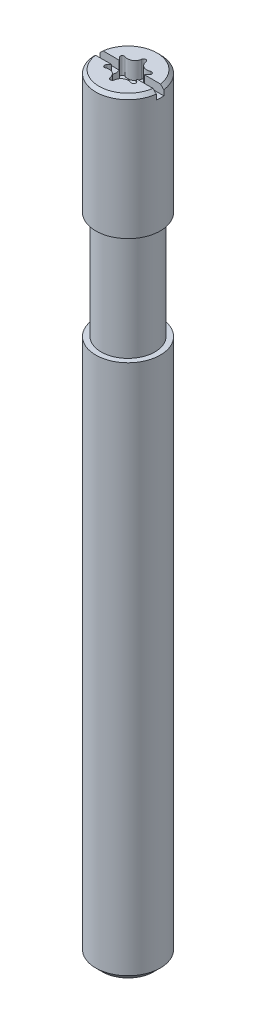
ISO-10303-21;
HEADER;
FILE_DESCRIPTION(('STEP AP214'),'2;1');
FILE_NAME('part.step','',(''),(''),'','','');
FILE_SCHEMA(('AUTOMOTIVE_DESIGN { 1 0 10303 214 1 1 1 1 }'));
ENDSEC;
DATA;
#1=APPLICATION_CONTEXT('core data for automotive mechanical design processes');
#2=APPLICATION_PROTOCOL_DEFINITION('international standard','automotive_design',2000,#1);
#3=PRODUCT_CONTEXT('',#1,'mechanical');
#4=PRODUCT('Part','Part','',(#3));
#5=PRODUCT_RELATED_PRODUCT_CATEGORY('part','',(#4));
#6=PRODUCT_DEFINITION_FORMATION('','',#4);
#7=PRODUCT_DEFINITION_CONTEXT('part definition',#1,'design');
#8=PRODUCT_DEFINITION('design','',#6,#7);
#9=PRODUCT_DEFINITION_SHAPE('','',#8);
#10=(LENGTH_UNIT() NAMED_UNIT(*) SI_UNIT(.MILLI.,.METRE.));
#11=(NAMED_UNIT(*) PLANE_ANGLE_UNIT() SI_UNIT($,.RADIAN.));
#12=(NAMED_UNIT(*) SI_UNIT($,.STERADIAN.) SOLID_ANGLE_UNIT());
#13=UNCERTAINTY_MEASURE_WITH_UNIT(LENGTH_MEASURE(1.E-05),#10,'distance_accuracy_value','');
#14=(GEOMETRIC_REPRESENTATION_CONTEXT(3) GLOBAL_UNCERTAINTY_ASSIGNED_CONTEXT((#13)) GLOBAL_UNIT_ASSIGNED_CONTEXT((#10,
#11,#12)) REPRESENTATION_CONTEXT('',''));
#15=CARTESIAN_POINT('',(0.,0.,0.));
#16=DIRECTION('',(0.,0.,1.));
#17=DIRECTION('',(1.,0.,0.));
#18=AXIS2_PLACEMENT_3D('',#15,#16,#17);
#19=CARTESIAN_POINT('',(-1.52237094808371,39.9,-0.362499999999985));
#20=DIRECTION('',(0.,1.,0.));
#21=DIRECTION('',(0.,0.,1.));
#22=AXIS2_PLACEMENT_3D('',#19,#20,#21);
#23=PLANE('',#22);
#24=CARTESIAN_POINT('',(-0.894502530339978,39.9,1.54932383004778));
#25=DIRECTION('',(0.,1.,0.));
#26=DIRECTION('',(0.,0.,1.));
#27=AXIS2_PLACEMENT_3D('',#24,#25,#26);
#28=CIRCLE('',#27,0.7);
#29=CARTESIAN_POINT('',(-0.198778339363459,39.9,1.47207196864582));
#30=VERTEX_POINT('',#29);
#31=CARTESIAN_POINT('',(-0.464026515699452,39.899999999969,0.997336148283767));
#32=VERTEX_POINT('',#31);
#33=EDGE_CURVE('E359',#30,#32,#28,.T.);
#34=ORIENTED_EDGE('',*,*,#33,.F.);
#35=CARTESIAN_POINT('',(0.,39.9,1.45));
#36=DIRECTION('',(0.,1.,0.));
#37=DIRECTION('',(0.,0.,1.));
#38=AXIS2_PLACEMENT_3D('',#35,#36,#37);
#39=CIRCLE('',#38,0.2);
#40=CARTESIAN_POINT('',(0.198778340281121,39.9,1.47207196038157));
#41=VERTEX_POINT('',#40);
#42=EDGE_CURVE('E568',#30,#41,#39,.T.);
#43=ORIENTED_EDGE('',*,*,#42,.T.);
#44=CARTESIAN_POINT('',(0.894502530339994,39.9,1.54932383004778));
#45=DIRECTION('',(0.,1.,0.));
#46=DIRECTION('',(0.,0.,1.));
#47=AXIS2_PLACEMENT_3D('',#44,#45,#46);
#48=CIRCLE('',#47,0.7);
#49=CARTESIAN_POINT('',(0.464026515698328,39.8999999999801,0.997336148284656));
#50=VERTEX_POINT('',#49);
#51=EDGE_CURVE('E634',#50,#41,#48,.T.);
#52=ORIENTED_EDGE('',*,*,#51,.F.);
#53=CARTESIAN_POINT('',(0.,39.8999999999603,0.));
#54=DIRECTION('',(0.,1.,0.));
#55=DIRECTION('',(0.,0.,1.));
#56=AXIS2_PLACEMENT_3D('',#53,#54,#55);
#57=CIRCLE('',#56,1.09999999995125);
#58=EDGE_CURVE('E595',#50,#32,#57,.F.);
#59=ORIENTED_EDGE('',*,*,#58,.T.);
#60=EDGE_LOOP('',(#34,#43,#52,#59));
#61=FACE_BOUND('',#60,.T.);
#62=ADVANCED_FACE('F14',(#61),#23,.T.);
#63=CARTESIAN_POINT('',(-1.52237094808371,39.9,-0.362499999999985));
#64=DIRECTION('',(0.,1.,0.));
#65=DIRECTION('',(0.,0.,1.));
#66=AXIS2_PLACEMENT_3D('',#63,#64,#65);
#67=PLANE('',#66);
#68=CARTESIAN_POINT('',(0.894502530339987,39.9,-1.54932383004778));
#69=DIRECTION('',(0.,1.,0.));
#70=DIRECTION('',(0.,0.,1.));
#71=AXIS2_PLACEMENT_3D('',#68,#69,#70);
#72=CIRCLE('',#71,0.7);
#73=CARTESIAN_POINT('',(0.198778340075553,39.9,-1.47207196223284));
#74=VERTEX_POINT('',#73);
#75=CARTESIAN_POINT('',(0.464026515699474,39.899999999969,-0.997336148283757));
#76=VERTEX_POINT('',#75);
#77=EDGE_CURVE('E631',#74,#76,#72,.T.);
#78=ORIENTED_EDGE('',*,*,#77,.F.);
#79=CARTESIAN_POINT('',(0.,39.9,-1.45));
#80=DIRECTION('',(0.,1.,0.));
#81=DIRECTION('',(0.,0.,1.));
#82=AXIS2_PLACEMENT_3D('',#79,#80,#81);
#83=CIRCLE('',#82,0.2);
#84=CARTESIAN_POINT('',(-0.198778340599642,39.9,-1.47207195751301));
#85=VERTEX_POINT('',#84);
#86=EDGE_CURVE('E643',#74,#85,#83,.T.);
#87=ORIENTED_EDGE('',*,*,#86,.T.);
#88=CARTESIAN_POINT('',(-0.894502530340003,39.9,-1.54932383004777));
#89=DIRECTION('',(0.,1.,0.));
#90=DIRECTION('',(0.,0.,1.));
#91=AXIS2_PLACEMENT_3D('',#88,#89,#90);
#92=CIRCLE('',#91,0.7);
#93=CARTESIAN_POINT('',(-0.46402651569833,39.8999999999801,-0.997336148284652));
#94=VERTEX_POINT('',#93);
#95=EDGE_CURVE('E279',#94,#85,#92,.T.);
#96=ORIENTED_EDGE('',*,*,#95,.F.);
#97=CARTESIAN_POINT('',(0.,39.8999999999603,0.));
#98=DIRECTION('',(0.,1.,0.));
#99=DIRECTION('',(0.,0.,1.));
#100=AXIS2_PLACEMENT_3D('',#97,#98,#99);
#101=CIRCLE('',#100,1.09999999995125);
#102=EDGE_CURVE('E647',#94,#76,#101,.F.);
#103=ORIENTED_EDGE('',*,*,#102,.T.);
#104=EDGE_LOOP('',(#78,#87,#96,#103));
#105=FACE_BOUND('',#104,.T.);
#106=ADVANCED_FACE('F314',(#105),#67,.T.);
#107=CARTESIAN_POINT('',(0.894502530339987,39.9,-1.54932383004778));
#108=DIRECTION('',(0.,1.,0.));
#109=DIRECTION('',(0.,0.,1.));
#110=AXIS2_PLACEMENT_3D('',#107,#108,#109);
#111=CYLINDRICAL_SURFACE('',#110,0.7);
#112=CARTESIAN_POINT('',(0.894502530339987,39.9,-1.54932383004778));
#113=DIRECTION('',(0.,1.,0.));
#114=DIRECTION('',(0.,0.,1.));
#115=AXIS2_PLACEMENT_3D('',#112,#113,#114);
#116=CIRCLE('',#115,0.7);
#117=CARTESIAN_POINT('',(0.631705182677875,39.8999999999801,-0.900526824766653));
#118=VERTEX_POINT('',#117);
#119=CARTESIAN_POINT('',(1.17546254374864,39.9,-0.908183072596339));
#120=VERTEX_POINT('',#119);
#121=EDGE_CURVE('E627',#118,#120,#116,.T.);
#122=ORIENTED_EDGE('',*,*,#121,.T.);
#123=DIRECTION('',(0.,1.,0.));
#124=VECTOR('',#123,1.);
#125=CARTESIAN_POINT('',(1.17546254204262,39.9,-0.908183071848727));
#126=LINE('',#125,#124);
#127=CARTESIAN_POINT('',(1.17546254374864,41.5,-0.908183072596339));
#128=VERTEX_POINT('',#127);
#129=EDGE_CURVE('E558',#120,#128,#126,.T.);
#130=ORIENTED_EDGE('',*,*,#129,.T.);
#131=CARTESIAN_POINT('',(0.894502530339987,41.5,-1.54932383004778));
#132=DIRECTION('',(0.,1.,0.));
#133=DIRECTION('',(0.,0.,1.));
#134=AXIS2_PLACEMENT_3D('',#131,#132,#133);
#135=CIRCLE('',#134,0.7);
#136=CARTESIAN_POINT('',(0.198778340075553,41.5,-1.47207196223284));
#137=VERTEX_POINT('',#136);
#138=EDGE_CURVE('E438',#128,#137,#135,.F.);
#139=ORIENTED_EDGE('',*,*,#138,.T.);
#140=DIRECTION('',(0.,1.,0.));
#141=VECTOR('',#140,1.);
#142=CARTESIAN_POINT('',(0.198778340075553,39.9,-1.47207196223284));
#143=LINE('',#142,#141);
#144=EDGE_CURVE('E628',#137,#74,#143,.F.);
#145=ORIENTED_EDGE('',*,*,#144,.T.);
#146=ORIENTED_EDGE('',*,*,#77,.T.);
#147=CARTESIAN_POINT('',(0.46402651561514,39.8999999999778,-0.997336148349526));
#148=CARTESIAN_POINT('',(0.489730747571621,39.8973321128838,-0.977317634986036));
#149=CARTESIAN_POINT('',(0.516556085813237,39.8959981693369,-0.959240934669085));
#150=CARTESIAN_POINT('',(0.572448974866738,39.8959981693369,-0.92697116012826));
#151=CARTESIAN_POINT('',(0.601516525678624,39.8973321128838,-0.912778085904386));
#152=CARTESIAN_POINT('',(0.631705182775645,39.8999999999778,-0.900526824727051));
#153=B_SPLINE_CURVE_WITH_KNOTS('',3,(#147,#148,#149,#150,#151,#152),.UNSPECIFIED.,.F.,.F.,(4,2,
4),(0.,0.097125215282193,0.194250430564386),.UNSPECIFIED.);
#154=EDGE_CURVE('E334',#76,#118,#153,.T.);
#155=ORIENTED_EDGE('',*,*,#154,.T.);
#156=EDGE_LOOP('',(#122,#130,#139,#145,#146,#155));
#157=FACE_BOUND('',#156,.T.);
#158=ADVANCED_FACE('F293',(#157),#111,.T.);
#159=CARTESIAN_POINT('',(0.,39.9,-1.45));
#160=DIRECTION('',(0.,1.,0.));
#161=DIRECTION('',(0.,0.,1.));
#162=AXIS2_PLACEMENT_3D('',#159,#160,#161);
#163=CYLINDRICAL_SURFACE('',#162,0.2);
#164=DIRECTION('',(0.,1.,0.));
#165=VECTOR('',#164,1.);
#166=CARTESIAN_POINT('',(-0.198778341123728,39.9,-1.47207195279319));
#167=LINE('',#166,#165);
#168=CARTESIAN_POINT('',(-0.198778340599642,41.5,-1.47207195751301));
#169=VERTEX_POINT('',#168);
#170=EDGE_CURVE('E458',#85,#169,#167,.T.);
#171=ORIENTED_EDGE('',*,*,#170,.F.);
#172=ORIENTED_EDGE('',*,*,#86,.F.);
#173=ORIENTED_EDGE('',*,*,#144,.F.);
#174=CARTESIAN_POINT('',(0.,41.5,-1.45));
#175=DIRECTION('',(0.,1.,0.));
#176=DIRECTION('',(0.,0.,1.));
#177=AXIS2_PLACEMENT_3D('',#174,#175,#176);
#178=CIRCLE('',#177,0.2);
#179=EDGE_CURVE('E642',#169,#137,#178,.F.);
#180=ORIENTED_EDGE('',*,*,#179,.F.);
#181=EDGE_LOOP('',(#171,#172,#173,#180));
#182=FACE_BOUND('',#181,.T.);
#183=ADVANCED_FACE('F291',(#182),#163,.F.);
#184=CARTESIAN_POINT('',(-0.894502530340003,39.9,-1.54932383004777));
#185=DIRECTION('',(0.,1.,0.));
#186=DIRECTION('',(0.,0.,1.));
#187=AXIS2_PLACEMENT_3D('',#184,#185,#186);
#188=CYLINDRICAL_SURFACE('',#187,0.7);
#189=ORIENTED_EDGE('',*,*,#95,.T.);
#190=ORIENTED_EDGE('',*,*,#170,.T.);
#191=CARTESIAN_POINT('',(-0.894502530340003,41.5,-1.54932383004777));
#192=DIRECTION('',(0.,1.,0.));
#193=DIRECTION('',(0.,0.,1.));
#194=AXIS2_PLACEMENT_3D('',#191,#192,#193);
#195=CIRCLE('',#194,0.7);
#196=CARTESIAN_POINT('',(-1.17546253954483,41.5,-0.908183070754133));
#197=VERTEX_POINT('',#196);
#198=EDGE_CURVE('E435',#169,#197,#195,.F.);
#199=ORIENTED_EDGE('',*,*,#198,.T.);
#200=DIRECTION('',(0.,1.,0.));
#201=VECTOR('',#200,1.);
#202=CARTESIAN_POINT('',(-1.17546253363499,39.9,-0.908183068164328));
#203=LINE('',#202,#201);
#204=CARTESIAN_POINT('',(-1.17546253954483,39.9,-0.908183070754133));
#205=VERTEX_POINT('',#204);
#206=EDGE_CURVE('E615',#197,#205,#203,.F.);
#207=ORIENTED_EDGE('',*,*,#206,.T.);
#208=CARTESIAN_POINT('',(-0.894502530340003,39.9,-1.54932383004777));
#209=DIRECTION('',(0.,1.,0.));
#210=DIRECTION('',(0.,0.,1.));
#211=AXIS2_PLACEMENT_3D('',#208,#209,#210);
#212=CIRCLE('',#211,0.7);
#213=CARTESIAN_POINT('',(-0.631705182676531,39.899999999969,-0.900526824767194));
#214=VERTEX_POINT('',#213);
#215=EDGE_CURVE('E304',#205,#214,#212,.T.);
#216=ORIENTED_EDGE('',*,*,#215,.T.);
#217=CARTESIAN_POINT('',(-0.631705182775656,39.8999999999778,-0.900526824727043));
#218=CARTESIAN_POINT('',(-0.601516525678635,39.8973321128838,-0.912778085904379));
#219=CARTESIAN_POINT('',(-0.572448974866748,39.8959981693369,-0.926971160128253));
#220=CARTESIAN_POINT('',(-0.516556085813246,39.8959981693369,-0.959240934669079));
#221=CARTESIAN_POINT('',(-0.48973074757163,39.8973321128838,-0.977317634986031));
#222=CARTESIAN_POINT('',(-0.464026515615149,39.8999999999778,-0.997336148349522));
#223=B_SPLINE_CURVE_WITH_KNOTS('',3,(#217,#218,#219,#220,#221,#222),.UNSPECIFIED.,.F.,.F.,(4,2,
4),(0.,0.0971252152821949,0.19425043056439),.UNSPECIFIED.);
#224=EDGE_CURVE('E296',#214,#94,#223,.T.);
#225=ORIENTED_EDGE('',*,*,#224,.T.);
#226=EDGE_LOOP('',(#189,#190,#199,#207,#216,#225));
#227=FACE_BOUND('',#226,.T.);
#228=ADVANCED_FACE('F286',(#227),#188,.T.);
#229=CARTESIAN_POINT('',(-1.25573683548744,39.9,-0.724999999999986));
#230=DIRECTION('',(0.,1.,0.));
#231=DIRECTION('',(0.,0.,1.));
#232=AXIS2_PLACEMENT_3D('',#229,#230,#231);
#233=CYLINDRICAL_SURFACE('',#232,0.2);
#234=DIRECTION('',(0.,1.,0.));
#235=VECTOR('',#234,1.);
#236=CARTESIAN_POINT('',(-1.37424087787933,39.9,-0.563888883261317));
#237=LINE('',#236,#235);
#238=CARTESIAN_POINT('',(-1.37424088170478,39.9,-0.563888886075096));
#239=VERTEX_POINT('',#238);
#240=CARTESIAN_POINT('',(-1.37424088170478,41.5,-0.563888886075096));
#241=VERTEX_POINT('',#240);
#242=EDGE_CURVE('E469',#239,#241,#237,.T.);
#243=ORIENTED_EDGE('',*,*,#242,.F.);
#244=CARTESIAN_POINT('',(-1.25573683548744,39.9,-0.724999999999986));
#245=DIRECTION('',(0.,1.,0.));
#246=DIRECTION('',(0.,0.,1.));
#247=AXIS2_PLACEMENT_3D('',#244,#245,#246);
#248=CIRCLE('',#247,0.2);
#249=EDGE_CURVE('E609',#205,#239,#248,.T.);
#250=ORIENTED_EDGE('',*,*,#249,.F.);
#251=ORIENTED_EDGE('',*,*,#206,.F.);
#252=CARTESIAN_POINT('',(-1.25573683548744,41.5,-0.724999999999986));
#253=DIRECTION('',(0.,1.,0.));
#254=DIRECTION('',(0.,0.,1.));
#255=AXIS2_PLACEMENT_3D('',#252,#253,#254);
#256=CIRCLE('',#255,0.2);
#257=EDGE_CURVE('E472',#241,#197,#256,.F.);
#258=ORIENTED_EDGE('',*,*,#257,.F.);
#259=EDGE_LOOP('',(#243,#250,#251,#258));
#260=FACE_BOUND('',#259,.T.);
#261=ADVANCED_FACE('F290',(#260),#233,.F.);
#262=CARTESIAN_POINT('',(-1.52237094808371,39.9,-0.362499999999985));
#263=DIRECTION('',(0.,1.,0.));
#264=DIRECTION('',(0.,0.,1.));
#265=AXIS2_PLACEMENT_3D('',#262,#263,#264);
#266=PLANE('',#265);
#267=ORIENTED_EDGE('',*,*,#215,.F.);
#268=ORIENTED_EDGE('',*,*,#249,.T.);
#269=CARTESIAN_POINT('',(-1.78900506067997,39.9,0.));
#270=DIRECTION('',(0.,1.,0.));
#271=DIRECTION('',(0.,0.,1.));
#272=AXIS2_PLACEMENT_3D('',#269,#270,#271);
#273=CIRCLE('',#272,0.7);
#274=CARTESIAN_POINT('',(-1.09573169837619,39.8999999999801,-0.0968093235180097));
#275=VERTEX_POINT('',#274);
#276=EDGE_CURVE('E516',#275,#239,#273,.T.);
#277=ORIENTED_EDGE('',*,*,#276,.F.);
#278=CARTESIAN_POINT('',(0.,39.8999999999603,0.));
#279=DIRECTION('',(0.,1.,0.));
#280=DIRECTION('',(0.,0.,1.));
#281=AXIS2_PLACEMENT_3D('',#278,#279,#280);
#282=CIRCLE('',#281,1.09999999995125);
#283=EDGE_CURVE('E600',#275,#214,#282,.F.);
#284=ORIENTED_EDGE('',*,*,#283,.T.);
#285=EDGE_LOOP('',(#267,#268,#277,#284));
#286=FACE_BOUND('',#285,.T.);
#287=ADVANCED_FACE('F316',(#286),#266,.T.);
#288=CARTESIAN_POINT('',(-1.52237094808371,39.9,-0.362499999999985));
#289=DIRECTION('',(0.,1.,0.));
#290=DIRECTION('',(0.,0.,1.));
#291=AXIS2_PLACEMENT_3D('',#288,#289,#290);
#292=PLANE('',#291);
#293=CARTESIAN_POINT('',(-1.78900506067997,39.9,0.));
#294=DIRECTION('',(0.,1.,0.));
#295=DIRECTION('',(0.,0.,1.));
#296=AXIS2_PLACEMENT_3D('',#293,#294,#295);
#297=CIRCLE('',#296,0.7);
#298=CARTESIAN_POINT('',(-1.09573169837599,39.8999999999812,0.0968093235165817));
#299=VERTEX_POINT('',#298);
#300=CARTESIAN_POINT('',(-1.37424089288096,39.9,0.563888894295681));
#301=VERTEX_POINT('',#300);
#302=EDGE_CURVE('E464',#299,#301,#297,.F.);
#303=ORIENTED_EDGE('',*,*,#302,.T.);
#304=CARTESIAN_POINT('',(-1.25573683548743,39.9,0.725000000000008));
#305=DIRECTION('',(0.,1.,0.));
#306=DIRECTION('',(0.,0.,1.));
#307=AXIS2_PLACEMENT_3D('',#304,#305,#306);
#308=CIRCLE('',#307,0.2);
#309=CARTESIAN_POINT('',(-1.17546254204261,39.9,0.90818307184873));
#310=VERTEX_POINT('',#309);
#311=EDGE_CURVE('E485',#301,#310,#308,.T.);
#312=ORIENTED_EDGE('',*,*,#311,.T.);
#313=CARTESIAN_POINT('',(-0.894502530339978,39.9,1.54932383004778));
#314=DIRECTION('',(0.,1.,0.));
#315=DIRECTION('',(0.,0.,1.));
#316=AXIS2_PLACEMENT_3D('',#313,#314,#315);
#317=CIRCLE('',#316,0.7);
#318=CARTESIAN_POINT('',(-0.631705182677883,39.8999999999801,0.900526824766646));
#319=VERTEX_POINT('',#318);
#320=EDGE_CURVE('E358',#319,#310,#317,.T.);
#321=ORIENTED_EDGE('',*,*,#320,.F.);
#322=CARTESIAN_POINT('',(0.,39.8999999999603,0.));
#323=DIRECTION('',(0.,1.,0.));
#324=DIRECTION('',(0.,0.,1.));
#325=AXIS2_PLACEMENT_3D('',#322,#323,#324);
#326=CIRCLE('',#325,1.09999999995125);
#327=EDGE_CURVE('E597',#319,#299,#326,.F.);
#328=ORIENTED_EDGE('',*,*,#327,.T.);
#329=EDGE_LOOP('',(#303,#312,#321,#328));
#330=FACE_BOUND('',#329,.T.);
#331=ADVANCED_FACE('F530',(#330),#292,.T.);
#332=CARTESIAN_POINT('',(-1.25573683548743,39.9,0.725000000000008));
#333=DIRECTION('',(0.,1.,0.));
#334=DIRECTION('',(0.,0.,1.));
#335=AXIS2_PLACEMENT_3D('',#332,#333,#334);
#336=CYLINDRICAL_SURFACE('',#335,0.2);
#337=DIRECTION('',(0.,1.,0.));
#338=VECTOR('',#337,1.);
#339=CARTESIAN_POINT('',(-1.17546253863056,39.9,0.908183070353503));
#340=LINE('',#339,#338);
#341=CARTESIAN_POINT('',(-1.17546254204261,41.5,0.90818307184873));
#342=VERTEX_POINT('',#341);
#343=EDGE_CURVE('E587',#310,#342,#340,.T.);
#344=ORIENTED_EDGE('',*,*,#343,.F.);
#345=ORIENTED_EDGE('',*,*,#311,.F.);
#346=DIRECTION('',(0.,1.,0.));
#347=VECTOR('',#346,1.);
#348=CARTESIAN_POINT('',(-1.3742409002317,39.9,0.563888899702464));
#349=LINE('',#348,#347);
#350=CARTESIAN_POINT('',(-1.37424089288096,41.5,0.563888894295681));
#351=VERTEX_POINT('',#350);
#352=EDGE_CURVE('E483',#351,#301,#349,.F.);
#353=ORIENTED_EDGE('',*,*,#352,.F.);
#354=CARTESIAN_POINT('',(-1.25573683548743,41.5,0.725000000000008));
#355=DIRECTION('',(0.,1.,0.));
#356=DIRECTION('',(0.,0.,1.));
#357=AXIS2_PLACEMENT_3D('',#354,#355,#356);
#358=CIRCLE('',#357,0.2);
#359=EDGE_CURVE('E482',#342,#351,#358,.F.);
#360=ORIENTED_EDGE('',*,*,#359,.F.);
#361=EDGE_LOOP('',(#344,#345,#353,#360));
#362=FACE_BOUND('',#361,.T.);
#363=ADVANCED_FACE('F366',(#362),#336,.F.);
#364=CARTESIAN_POINT('',(-0.894502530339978,39.9,1.54932383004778));
#365=DIRECTION('',(0.,1.,0.));
#366=DIRECTION('',(0.,0.,1.));
#367=AXIS2_PLACEMENT_3D('',#364,#365,#366);
#368=CYLINDRICAL_SURFACE('',#367,0.7);
#369=ORIENTED_EDGE('',*,*,#320,.T.);
#370=ORIENTED_EDGE('',*,*,#343,.T.);
#371=CARTESIAN_POINT('',(-0.894502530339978,41.5,1.54932383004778));
#372=DIRECTION('',(0.,1.,0.));
#373=DIRECTION('',(0.,0.,1.));
#374=AXIS2_PLACEMENT_3D('',#371,#372,#373);
#375=CIRCLE('',#374,0.7);
#376=CARTESIAN_POINT('',(-0.198778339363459,41.5,1.47207196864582));
#377=VERTEX_POINT('',#376);
#378=EDGE_CURVE('E277',#342,#377,#375,.F.);
#379=ORIENTED_EDGE('',*,*,#378,.T.);
#380=DIRECTION('',(0.,1.,0.));
#381=VECTOR('',#380,1.);
#382=CARTESIAN_POINT('',(-0.198778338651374,39.9,1.4720719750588));
#383=LINE('',#382,#381);
#384=EDGE_CURVE('E636',#377,#30,#383,.F.);
#385=ORIENTED_EDGE('',*,*,#384,.T.);
#386=ORIENTED_EDGE('',*,*,#33,.T.);
#387=CARTESIAN_POINT('',(-0.464026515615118,39.8999999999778,0.997336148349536));
#388=CARTESIAN_POINT('',(-0.489730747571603,39.8973321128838,0.977317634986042));
#389=CARTESIAN_POINT('',(-0.516556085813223,39.8959981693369,0.959240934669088));
#390=CARTESIAN_POINT('',(-0.572448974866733,39.8959981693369,0.926971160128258));
#391=CARTESIAN_POINT('',(-0.601516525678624,39.8973321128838,0.912778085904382));
#392=CARTESIAN_POINT('',(-0.63170518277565,39.8999999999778,0.900526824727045));
#393=B_SPLINE_CURVE_WITH_KNOTS('',3,(#387,#388,#389,#390,#391,#392),.UNSPECIFIED.,.F.,.F.,(4,2,
4),(0.,0.0971252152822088,0.194250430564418),.UNSPECIFIED.);
#394=EDGE_CURVE('E349',#32,#319,#393,.T.);
#395=ORIENTED_EDGE('',*,*,#394,.T.);
#396=EDGE_LOOP('',(#369,#370,#379,#385,#386,#395));
#397=FACE_BOUND('',#396,.T.);
#398=ADVANCED_FACE('F361',(#397),#368,.T.);
#399=CARTESIAN_POINT('',(0.,39.9,1.45));
#400=DIRECTION('',(0.,1.,0.));
#401=DIRECTION('',(0.,0.,1.));
#402=AXIS2_PLACEMENT_3D('',#399,#400,#401);
#403=CYLINDRICAL_SURFACE('',#402,0.2);
#404=DIRECTION('',(0.,1.,0.));
#405=VECTOR('',#404,1.);
#406=CARTESIAN_POINT('',(0.198778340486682,39.9,1.4720719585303));
#407=LINE('',#406,#405);
#408=CARTESIAN_POINT('',(0.198778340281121,41.5,1.47207196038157));
#409=VERTEX_POINT('',#408);
#410=EDGE_CURVE('E632',#41,#409,#407,.T.);
#411=ORIENTED_EDGE('',*,*,#410,.F.);
#412=ORIENTED_EDGE('',*,*,#42,.F.);
#413=ORIENTED_EDGE('',*,*,#384,.F.);
#414=CARTESIAN_POINT('',(0.,41.5,1.45));
#415=DIRECTION('',(0.,1.,0.));
#416=DIRECTION('',(0.,0.,1.));
#417=AXIS2_PLACEMENT_3D('',#414,#415,#416);
#418=CIRCLE('',#417,0.2);
#419=EDGE_CURVE('E566',#409,#377,#418,.F.);
#420=ORIENTED_EDGE('',*,*,#419,.F.);
#421=EDGE_LOOP('',(#411,#412,#413,#420));
#422=FACE_BOUND('',#421,.T.);
#423=ADVANCED_FACE('F365',(#422),#403,.F.);
#424=CARTESIAN_POINT('',(0.894502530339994,39.9,1.54932383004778));
#425=DIRECTION('',(0.,1.,0.));
#426=DIRECTION('',(0.,0.,1.));
#427=AXIS2_PLACEMENT_3D('',#424,#425,#426);
#428=CYLINDRICAL_SURFACE('',#427,0.7);
#429=ORIENTED_EDGE('',*,*,#51,.T.);
#430=ORIENTED_EDGE('',*,*,#410,.T.);
#431=CARTESIAN_POINT('',(0.894502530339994,41.5,1.54932383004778));
#432=DIRECTION('',(0.,1.,0.));
#433=DIRECTION('',(0.,0.,1.));
#434=AXIS2_PLACEMENT_3D('',#431,#432,#433);
#435=CIRCLE('',#434,0.7);
#436=CARTESIAN_POINT('',(1.17546253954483,41.5,0.908183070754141));
#437=VERTEX_POINT('',#436);
#438=EDGE_CURVE('E440',#409,#437,#435,.F.);
#439=ORIENTED_EDGE('',*,*,#438,.T.);
#440=DIRECTION('',(0.,1.,0.));
#441=VECTOR('',#440,1.);
#442=CARTESIAN_POINT('',(1.17546253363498,39.9,0.908183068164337));
#443=LINE('',#442,#441);
#444=CARTESIAN_POINT('',(1.17546253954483,39.9,0.908183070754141));
#445=VERTEX_POINT('',#444);
#446=EDGE_CURVE('E588',#437,#445,#443,.F.);
#447=ORIENTED_EDGE('',*,*,#446,.T.);
#448=CARTESIAN_POINT('',(0.894502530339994,39.9,1.54932383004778));
#449=DIRECTION('',(0.,1.,0.));
#450=DIRECTION('',(0.,0.,1.));
#451=AXIS2_PLACEMENT_3D('',#448,#449,#450);
#452=CIRCLE('',#451,0.7);
#453=CARTESIAN_POINT('',(0.631705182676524,39.899999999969,0.900526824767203));
#454=VERTEX_POINT('',#453);
#455=EDGE_CURVE('E635',#445,#454,#452,.T.);
#456=ORIENTED_EDGE('',*,*,#455,.T.);
#457=CARTESIAN_POINT('',(0.631705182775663,39.8999999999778,0.900526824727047));
#458=CARTESIAN_POINT('',(0.601516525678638,39.8973321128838,0.912778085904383));
#459=CARTESIAN_POINT('',(0.572448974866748,39.8959981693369,0.926971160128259));
#460=CARTESIAN_POINT('',(0.516556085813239,39.8959981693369,0.959240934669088));
#461=CARTESIAN_POINT('',(0.48973074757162,39.8973321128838,0.977317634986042));
#462=CARTESIAN_POINT('',(0.464026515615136,39.8999999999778,0.997336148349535));
#463=B_SPLINE_CURVE_WITH_KNOTS('',3,(#457,#458,#459,#460,#461,#462),.UNSPECIFIED.,.F.,.F.,(4,2,
4),(0.,0.097125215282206,0.194250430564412),.UNSPECIFIED.);
#464=EDGE_CURVE('E341',#454,#50,#463,.T.);
#465=ORIENTED_EDGE('',*,*,#464,.T.);
#466=EDGE_LOOP('',(#429,#430,#439,#447,#456,#465));
#467=FACE_BOUND('',#466,.T.);
#468=ADVANCED_FACE('F368',(#467),#428,.T.);
#469=CARTESIAN_POINT('',(-1.52237094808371,39.9,-0.362499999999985));
#470=DIRECTION('',(0.,1.,0.));
#471=DIRECTION('',(0.,0.,1.));
#472=AXIS2_PLACEMENT_3D('',#469,#470,#471);
#473=PLANE('',#472);
#474=ORIENTED_EDGE('',*,*,#455,.F.);
#475=CARTESIAN_POINT('',(1.25573683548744,39.9,0.725));
#476=DIRECTION('',(0.,1.,0.));
#477=DIRECTION('',(0.,0.,1.));
#478=AXIS2_PLACEMENT_3D('',#475,#476,#477);
#479=CIRCLE('',#478,0.2);
#480=CARTESIAN_POINT('',(1.37424088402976,39.9,0.563888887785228));
#481=VERTEX_POINT('',#480);
#482=EDGE_CURVE('E570',#445,#481,#479,.T.);
#483=ORIENTED_EDGE('',*,*,#482,.T.);
#484=CARTESIAN_POINT('',(1.78900506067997,39.9,0.));
#485=DIRECTION('',(0.,1.,0.));
#486=DIRECTION('',(0.,0.,1.));
#487=AXIS2_PLACEMENT_3D('',#484,#485,#486);
#488=CIRCLE('',#487,0.7);
#489=CARTESIAN_POINT('',(1.09573169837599,39.8999999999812,0.0968093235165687));
#490=VERTEX_POINT('',#489);
#491=EDGE_CURVE('E573',#481,#490,#488,.F.);
#492=ORIENTED_EDGE('',*,*,#491,.T.);
#493=CARTESIAN_POINT('',(0.,39.8999999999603,0.));
#494=DIRECTION('',(0.,1.,0.));
#495=DIRECTION('',(0.,0.,1.));
#496=AXIS2_PLACEMENT_3D('',#493,#494,#495);
#497=CIRCLE('',#496,1.09999999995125);
#498=EDGE_CURVE('E604',#490,#454,#497,.F.);
#499=ORIENTED_EDGE('',*,*,#498,.T.);
#500=EDGE_LOOP('',(#474,#483,#492,#499));
#501=FACE_BOUND('',#500,.T.);
#502=ADVANCED_FACE('F312',(#501),#473,.T.);
#503=CARTESIAN_POINT('',(0.,39.8999999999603,0.));
#504=DIRECTION('',(0.,1.,0.));
#505=DIRECTION('',(0.,0.,1.));
#506=AXIS2_PLACEMENT_3D('',#503,#504,#505);
#507=CONICAL_SURFACE('',#506,1.09999999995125,1.22173047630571);
#508=CARTESIAN_POINT('',(1.13686837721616E-10,39.4996327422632,0.));
#509=VERTEX_POINT('',#508);
#510=VERTEX_LOOP('',#509);
#511=FACE_BOUND('',#510,.T.);
#512=CARTESIAN_POINT('',(0.,39.8999999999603,0.));
#513=DIRECTION('',(0.,1.,0.));
#514=DIRECTION('',(0.,0.,1.));
#515=AXIS2_PLACEMENT_3D('',#512,#513,#514);
#516=CIRCLE('',#515,1.09999999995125);
#517=CARTESIAN_POINT('',(1.09573169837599,39.8999999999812,-0.0968093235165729));
#518=VERTEX_POINT('',#517);
#519=EDGE_CURVE('E602',#118,#518,#516,.F.);
#520=ORIENTED_EDGE('',*,*,#519,.F.);
#521=ORIENTED_EDGE('',*,*,#154,.F.);
#522=ORIENTED_EDGE('',*,*,#102,.F.);
#523=ORIENTED_EDGE('',*,*,#224,.F.);
#524=ORIENTED_EDGE('',*,*,#283,.F.);
#525=CARTESIAN_POINT('',(-1.09573169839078,39.8999999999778,0.0968093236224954));
#526=CARTESIAN_POINT('',(-1.09124727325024,39.8973321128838,0.0645395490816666));
#527=CARTESIAN_POINT('',(-1.08900506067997,39.8959981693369,0.0322697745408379));
#528=CARTESIAN_POINT('',(-1.08900506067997,39.8959981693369,-0.0322697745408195));
#529=CARTESIAN_POINT('',(-1.09124727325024,39.8973321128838,-0.0645395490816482));
#530=CARTESIAN_POINT('',(-1.09573169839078,39.8999999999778,-0.0968093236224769));
#531=B_SPLINE_CURVE_WITH_KNOTS('',3,(#525,#526,#527,#528,#529,#530),.UNSPECIFIED.,.F.,.F.,(4,2,
4),(0.,0.097125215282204,0.194250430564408),.UNSPECIFIED.);
#532=EDGE_CURVE('E321',#299,#275,#531,.T.);
#533=ORIENTED_EDGE('',*,*,#532,.F.);
#534=ORIENTED_EDGE('',*,*,#327,.F.);
#535=ORIENTED_EDGE('',*,*,#394,.F.);
#536=ORIENTED_EDGE('',*,*,#58,.F.);
#537=ORIENTED_EDGE('',*,*,#464,.F.);
#538=ORIENTED_EDGE('',*,*,#498,.F.);
#539=CARTESIAN_POINT('',(1.09573169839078,39.8999999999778,-0.0968093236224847));
#540=CARTESIAN_POINT('',(1.09124727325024,39.8973321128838,-0.0645395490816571));
#541=CARTESIAN_POINT('',(1.08900506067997,39.8959981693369,-0.0322697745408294));
#542=CARTESIAN_POINT('',(1.08900506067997,39.8959981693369,0.0322697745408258));
#543=CARTESIAN_POINT('',(1.09124727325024,39.8973321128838,0.0645395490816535));
#544=CARTESIAN_POINT('',(1.09573169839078,39.8999999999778,0.0968093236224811));
#545=B_SPLINE_CURVE_WITH_KNOTS('',3,(#539,#540,#541,#542,#543,#544),.UNSPECIFIED.,.F.,.F.,(4,2,
4),(0.,0.0971252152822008,0.194250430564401),.UNSPECIFIED.);
#546=EDGE_CURVE('E538',#518,#490,#545,.T.);
#547=ORIENTED_EDGE('',*,*,#546,.F.);
#548=EDGE_LOOP('',(#520,#521,#522,#523,#524,#533,#534,#535,#536,#537,#538,#547));
#549=FACE_BOUND('',#548,.T.);
#550=ADVANCED_FACE('F306',(#511,#549),#507,.F.);
#551=CARTESIAN_POINT('',(-1.52237094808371,39.9,-0.362499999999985));
#552=DIRECTION('',(0.,1.,0.));
#553=DIRECTION('',(0.,0.,1.));
#554=AXIS2_PLACEMENT_3D('',#551,#552,#553);
#555=PLANE('',#554);
#556=CARTESIAN_POINT('',(1.78900506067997,39.9,0.));
#557=DIRECTION('',(0.,1.,0.));
#558=DIRECTION('',(0.,0.,1.));
#559=AXIS2_PLACEMENT_3D('',#556,#557,#558);
#560=CIRCLE('',#559,0.7);
#561=CARTESIAN_POINT('',(1.37424088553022,39.9,-0.563888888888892));
#562=VERTEX_POINT('',#561);
#563=EDGE_CURVE('E477',#518,#562,#560,.F.);
#564=ORIENTED_EDGE('',*,*,#563,.T.);
#565=CARTESIAN_POINT('',(1.25573683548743,39.9,-0.725));
#566=DIRECTION('',(0.,1.,0.));
#567=DIRECTION('',(0.,0.,1.));
#568=AXIS2_PLACEMENT_3D('',#565,#566,#567);
#569=CIRCLE('',#568,0.2);
#570=EDGE_CURVE('E476',#562,#120,#569,.T.);
#571=ORIENTED_EDGE('',*,*,#570,.T.);
#572=ORIENTED_EDGE('',*,*,#121,.F.);
#573=ORIENTED_EDGE('',*,*,#519,.T.);
#574=EDGE_LOOP('',(#564,#571,#572,#573));
#575=FACE_BOUND('',#574,.T.);
#576=ADVANCED_FACE('F311',(#575),#555,.T.);
#577=CARTESIAN_POINT('',(1.25573683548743,39.9,-0.725));
#578=DIRECTION('',(0.,1.,0.));
#579=DIRECTION('',(0.,0.,1.));
#580=AXIS2_PLACEMENT_3D('',#577,#578,#579);
#581=CYLINDRICAL_SURFACE('',#580,0.2);
#582=ORIENTED_EDGE('',*,*,#129,.F.);
#583=ORIENTED_EDGE('',*,*,#570,.F.);
#584=DIRECTION('',(0.,1.,0.));
#585=VECTOR('',#584,1.);
#586=CARTESIAN_POINT('',(1.37424088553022,39.9,-0.563888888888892));
#587=LINE('',#586,#585);
#588=CARTESIAN_POINT('',(1.37424088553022,41.5,-0.563888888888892));
#589=VERTEX_POINT('',#588);
#590=EDGE_CURVE('E474',#589,#562,#587,.F.);
#591=ORIENTED_EDGE('',*,*,#590,.F.);
#592=CARTESIAN_POINT('',(1.25573683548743,41.5,-0.725));
#593=DIRECTION('',(0.,1.,0.));
#594=DIRECTION('',(0.,0.,1.));
#595=AXIS2_PLACEMENT_3D('',#592,#593,#594);
#596=CIRCLE('',#595,0.2);
#597=EDGE_CURVE('E473',#128,#589,#596,.F.);
#598=ORIENTED_EDGE('',*,*,#597,.F.);
#599=EDGE_LOOP('',(#582,#583,#591,#598));
#600=FACE_BOUND('',#599,.T.);
#601=ADVANCED_FACE('F557',(#600),#581,.F.);
#602=CARTESIAN_POINT('',(1.25573683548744,39.9,0.725));
#603=DIRECTION('',(0.,1.,0.));
#604=DIRECTION('',(0.,0.,1.));
#605=AXIS2_PLACEMENT_3D('',#602,#603,#604);
#606=CYLINDRICAL_SURFACE('',#605,0.2);
#607=DIRECTION('',(0.,1.,0.));
#608=VECTOR('',#607,1.);
#609=CARTESIAN_POINT('',(1.3742408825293,39.9,0.563888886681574));
#610=LINE('',#609,#608);
#611=CARTESIAN_POINT('',(1.37424088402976,41.5,0.563888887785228));
#612=VERTEX_POINT('',#611);
#613=EDGE_CURVE('E478',#481,#612,#610,.T.);
#614=ORIENTED_EDGE('',*,*,#613,.F.);
#615=ORIENTED_EDGE('',*,*,#482,.F.);
#616=ORIENTED_EDGE('',*,*,#446,.F.);
#617=CARTESIAN_POINT('',(1.25573683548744,41.5,0.725));
#618=DIRECTION('',(0.,1.,0.));
#619=DIRECTION('',(0.,0.,1.));
#620=AXIS2_PLACEMENT_3D('',#617,#618,#619);
#621=CIRCLE('',#620,0.2);
#622=EDGE_CURVE('E481',#612,#437,#621,.F.);
#623=ORIENTED_EDGE('',*,*,#622,.F.);
#624=EDGE_LOOP('',(#614,#615,#616,#623));
#625=FACE_BOUND('',#624,.T.);
#626=ADVANCED_FACE('F659',(#625),#606,.F.);
#627=CARTESIAN_POINT('',(0.,41.5,0.));
#628=DIRECTION('',(0.,-1.,0.));
#629=DIRECTION('',(0.,0.,-1.));
#630=AXIS2_PLACEMENT_3D('',#627,#628,#629);
#631=PLANE('',#630);
#632=CARTESIAN_POINT('',(0.,41.4999999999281,0.));
#633=DIRECTION('',(0.,-1.,0.));
#634=DIRECTION('',(0.,0.,-1.));
#635=AXIS2_PLACEMENT_3D('',#632,#633,#634);
#636=CIRCLE('',#635,2.69350000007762);
#637=CARTESIAN_POINT('',(-2.67066326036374,41.4999999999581,-0.35));
#638=VERTEX_POINT('',#637);
#639=CARTESIAN_POINT('',(2.67066326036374,41.4999999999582,-0.35));
#640=VERTEX_POINT('',#639);
#641=EDGE_CURVE('E224',#638,#640,#636,.T.);
#642=ORIENTED_EDGE('',*,*,#641,.F.);
#643=DIRECTION('',(1.,0.,0.));
#644=VECTOR('',#643,1.);
#645=CARTESIAN_POINT('',(0.,41.5,-0.35));
#646=LINE('',#645,#644);
#647=CARTESIAN_POINT('',(-1.18278727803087,41.5,-0.35));
#648=VERTEX_POINT('',#647);
#649=EDGE_CURVE('E251',#648,#638,#646,.F.);
#650=ORIENTED_EDGE('',*,*,#649,.F.);
#651=CARTESIAN_POINT('',(-1.78900506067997,41.5,0.));
#652=DIRECTION('',(0.,1.,0.));
#653=DIRECTION('',(0.,0.,1.));
#654=AXIS2_PLACEMENT_3D('',#651,#652,#653);
#655=CIRCLE('',#654,0.7);
#656=EDGE_CURVE('E490',#241,#648,#655,.F.);
#657=ORIENTED_EDGE('',*,*,#656,.F.);
#658=ORIENTED_EDGE('',*,*,#257,.T.);
#659=ORIENTED_EDGE('',*,*,#198,.F.);
#660=ORIENTED_EDGE('',*,*,#179,.T.);
#661=ORIENTED_EDGE('',*,*,#138,.F.);
#662=ORIENTED_EDGE('',*,*,#597,.T.);
#663=CARTESIAN_POINT('',(1.78900506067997,41.5,0.));
#664=DIRECTION('',(0.,1.,0.));
#665=DIRECTION('',(0.,0.,1.));
#666=AXIS2_PLACEMENT_3D('',#663,#664,#665);
#667=CIRCLE('',#666,0.7);
#668=CARTESIAN_POINT('',(1.18278727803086,41.5,-0.35));
#669=VERTEX_POINT('',#668);
#670=EDGE_CURVE('E497',#669,#589,#667,.F.);
#671=ORIENTED_EDGE('',*,*,#670,.F.);
#672=DIRECTION('',(1.,0.,0.));
#673=VECTOR('',#672,1.);
#674=CARTESIAN_POINT('',(0.,41.5,-0.35));
#675=LINE('',#674,#673);
#676=EDGE_CURVE('E225',#640,#669,#675,.F.);
#677=ORIENTED_EDGE('',*,*,#676,.F.);
#678=EDGE_LOOP('',(#642,#650,#657,#658,#659,#660,#661,#662,#671,#677));
#679=FACE_BOUND('',#678,.T.);
#680=ADVANCED_FACE('F534',(#679),#631,.F.);
#681=CARTESIAN_POINT('',(-1.78900506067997,39.9,0.));
#682=DIRECTION('',(0.,1.,0.));
#683=DIRECTION('',(0.,0.,1.));
#684=AXIS2_PLACEMENT_3D('',#681,#682,#683);
#685=CYLINDRICAL_SURFACE('',#684,0.7);
#686=DIRECTION('',(0.,1.,0.));
#687=VECTOR('',#686,1.);
#688=CARTESIAN_POINT('',(-1.18278727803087,39.9,-0.35));
#689=LINE('',#688,#687);
#690=CARTESIAN_POINT('',(-1.18278727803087,40.7,-0.35));
#691=VERTEX_POINT('',#690);
#692=EDGE_CURVE('E468',#648,#691,#689,.F.);
#693=ORIENTED_EDGE('',*,*,#692,.T.);
#694=CARTESIAN_POINT('',(-1.78900506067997,40.7,0.));
#695=DIRECTION('',(0.,1.,0.));
#696=DIRECTION('',(0.,0.,1.));
#697=AXIS2_PLACEMENT_3D('',#694,#695,#696);
#698=CIRCLE('',#697,0.7);
#699=CARTESIAN_POINT('',(-1.18278727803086,40.7,0.35));
#700=VERTEX_POINT('',#699);
#701=EDGE_CURVE('E236',#700,#691,#698,.T.);
#702=ORIENTED_EDGE('',*,*,#701,.F.);
#703=DIRECTION('',(0.,1.,0.));
#704=VECTOR('',#703,1.);
#705=CARTESIAN_POINT('',(-1.18278727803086,0.,0.35));
#706=LINE('',#705,#704);
#707=CARTESIAN_POINT('',(-1.18278727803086,41.5,0.35));
#708=VERTEX_POINT('',#707);
#709=EDGE_CURVE('E215',#700,#708,#706,.T.);
#710=ORIENTED_EDGE('',*,*,#709,.T.);
#711=CARTESIAN_POINT('',(-1.78900506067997,41.5,0.));
#712=DIRECTION('',(0.,1.,0.));
#713=DIRECTION('',(0.,0.,1.));
#714=AXIS2_PLACEMENT_3D('',#711,#712,#713);
#715=CIRCLE('',#714,0.7);
#716=EDGE_CURVE('E212',#708,#351,#715,.F.);
#717=ORIENTED_EDGE('',*,*,#716,.T.);
#718=ORIENTED_EDGE('',*,*,#352,.T.);
#719=ORIENTED_EDGE('',*,*,#302,.F.);
#720=ORIENTED_EDGE('',*,*,#532,.T.);
#721=ORIENTED_EDGE('',*,*,#276,.T.);
#722=ORIENTED_EDGE('',*,*,#242,.T.);
#723=ORIENTED_EDGE('',*,*,#656,.T.);
#724=EDGE_LOOP('',(#693,#702,#710,#717,#718,#719,#720,#721,#722,#723));
#725=FACE_BOUND('',#724,.T.);
#726=ADVANCED_FACE('F508',(#725),#685,.T.);
#727=CARTESIAN_POINT('',(0.,41.5,0.));
#728=DIRECTION('',(0.,-1.,0.));
#729=DIRECTION('',(0.,0.,-1.));
#730=AXIS2_PLACEMENT_3D('',#727,#728,#729);
#731=PLANE('',#730);
#732=DIRECTION('',(1.,0.,0.));
#733=VECTOR('',#732,1.);
#734=CARTESIAN_POINT('',(0.,41.5,0.35));
#735=LINE('',#734,#733);
#736=CARTESIAN_POINT('',(2.67066326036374,41.4999999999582,0.35));
#737=VERTEX_POINT('',#736);
#738=CARTESIAN_POINT('',(1.18278727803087,41.5,0.35));
#739=VERTEX_POINT('',#738);
#740=EDGE_CURVE('E465',#737,#739,#735,.F.);
#741=ORIENTED_EDGE('',*,*,#740,.T.);
#742=CARTESIAN_POINT('',(1.78900506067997,41.5,0.));
#743=DIRECTION('',(0.,1.,0.));
#744=DIRECTION('',(0.,0.,1.));
#745=AXIS2_PLACEMENT_3D('',#742,#743,#744);
#746=CIRCLE('',#745,0.7);
#747=EDGE_CURVE('E544',#612,#739,#746,.F.);
#748=ORIENTED_EDGE('',*,*,#747,.F.);
#749=ORIENTED_EDGE('',*,*,#622,.T.);
#750=ORIENTED_EDGE('',*,*,#438,.F.);
#751=ORIENTED_EDGE('',*,*,#419,.T.);
#752=ORIENTED_EDGE('',*,*,#378,.F.);
#753=ORIENTED_EDGE('',*,*,#359,.T.);
#754=ORIENTED_EDGE('',*,*,#716,.F.);
#755=DIRECTION('',(1.,0.,0.));
#756=VECTOR('',#755,1.);
#757=CARTESIAN_POINT('',(0.,41.5,0.35));
#758=LINE('',#757,#756);
#759=CARTESIAN_POINT('',(-2.67066326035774,41.4999999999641,0.35));
#760=VERTEX_POINT('',#759);
#761=EDGE_CURVE('E206',#708,#760,#758,.F.);
#762=ORIENTED_EDGE('',*,*,#761,.T.);
#763=CARTESIAN_POINT('',(0.,41.4999999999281,0.));
#764=DIRECTION('',(0.,-1.,0.));
#765=DIRECTION('',(0.,0.,-1.));
#766=AXIS2_PLACEMENT_3D('',#763,#764,#765);
#767=CIRCLE('',#766,2.69350000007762);
#768=EDGE_CURVE('E209',#737,#760,#767,.T.);
#769=ORIENTED_EDGE('',*,*,#768,.F.);
#770=EDGE_LOOP('',(#741,#748,#749,#750,#751,#752,#753,#754,#762,#769));
#771=FACE_BOUND('',#770,.T.);
#772=ADVANCED_FACE('F208',(#771),#731,.F.);
#773=CARTESIAN_POINT('',(1.78900506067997,39.9,0.));
#774=DIRECTION('',(0.,1.,0.));
#775=DIRECTION('',(0.,0.,1.));
#776=AXIS2_PLACEMENT_3D('',#773,#774,#775);
#777=CYLINDRICAL_SURFACE('',#776,0.7);
#778=ORIENTED_EDGE('',*,*,#613,.T.);
#779=ORIENTED_EDGE('',*,*,#747,.T.);
#780=DIRECTION('',(0.,1.,0.));
#781=VECTOR('',#780,1.);
#782=CARTESIAN_POINT('',(1.18278727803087,0.,0.35));
#783=LINE('',#782,#781);
#784=CARTESIAN_POINT('',(1.18278727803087,40.7,0.35));
#785=VERTEX_POINT('',#784);
#786=EDGE_CURVE('E461',#739,#785,#783,.F.);
#787=ORIENTED_EDGE('',*,*,#786,.T.);
#788=CARTESIAN_POINT('',(1.78900506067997,40.7,0.));
#789=DIRECTION('',(0.,1.,0.));
#790=DIRECTION('',(0.,0.,1.));
#791=AXIS2_PLACEMENT_3D('',#788,#789,#790);
#792=CIRCLE('',#791,0.7);
#793=CARTESIAN_POINT('',(1.18278727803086,40.7,-0.35));
#794=VERTEX_POINT('',#793);
#795=EDGE_CURVE('E250',#785,#794,#792,.F.);
#796=ORIENTED_EDGE('',*,*,#795,.T.);
#797=DIRECTION('',(0.,1.,0.));
#798=VECTOR('',#797,1.);
#799=CARTESIAN_POINT('',(1.18278727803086,39.9,-0.35));
#800=LINE('',#799,#798);
#801=EDGE_CURVE('E494',#794,#669,#800,.T.);
#802=ORIENTED_EDGE('',*,*,#801,.T.);
#803=ORIENTED_EDGE('',*,*,#670,.T.);
#804=ORIENTED_EDGE('',*,*,#590,.T.);
#805=ORIENTED_EDGE('',*,*,#563,.F.);
#806=ORIENTED_EDGE('',*,*,#546,.T.);
#807=ORIENTED_EDGE('',*,*,#491,.F.);
#808=EDGE_LOOP('',(#778,#779,#787,#796,#802,#803,#804,#805,#806,#807));
#809=FACE_BOUND('',#808,.T.);
#810=ADVANCED_FACE('F285',(#809),#777,.T.);
#811=CARTESIAN_POINT('',(0.,0.,-0.35));
#812=DIRECTION('',(0.,0.,1.));
#813=DIRECTION('',(1.,0.,0.));
#814=AXIS2_PLACEMENT_3D('',#811,#812,#813);
#815=PLANE('',#814);
#816=ORIENTED_EDGE('',*,*,#801,.F.);
#817=DIRECTION('',(1.,0.,0.));
#818=VECTOR('',#817,1.);
#819=CARTESIAN_POINT('',(0.,40.7,-0.35));
#820=LINE('',#819,#818);
#821=CARTESIAN_POINT('',(2.97951338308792,40.7,-0.35));
#822=VERTEX_POINT('',#821);
#823=EDGE_CURVE('E275',#794,#822,#820,.T.);
#824=ORIENTED_EDGE('',*,*,#823,.T.);
#825=DIRECTION('',(0.,1.,0.));
#826=VECTOR('',#825,1.);
#827=CARTESIAN_POINT('',(2.97951338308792,0.,-0.35));
#828=LINE('',#827,#826);
#829=CARTESIAN_POINT('',(2.97951338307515,41.1934999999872,-0.35));
#830=VERTEX_POINT('',#829);
#831=EDGE_CURVE('E276',#822,#830,#828,.T.);
#832=ORIENTED_EDGE('',*,*,#831,.T.);
#833=CARTESIAN_POINT('',(2.97951338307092,41.1934999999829,-0.350000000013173));
#834=CARTESIAN_POINT('',(2.92805952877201,41.2446046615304,-0.350000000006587));
#835=CARTESIAN_POINT('',(2.87659509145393,41.2956986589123,-0.350000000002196));
#836=CARTESIAN_POINT('',(2.77364505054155,41.3978653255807,-0.349999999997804));
#837=CARTESIAN_POINT('',(2.72215944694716,41.4489379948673,-0.349999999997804));
#838=CARTESIAN_POINT('',(2.67066326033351,41.4999999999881,-0.35));
#839=B_SPLINE_CURVE_WITH_KNOTS('',3,(#833,#834,#835,#836,#837,#838),.UNSPECIFIED.,.F.,.F.,(4,2,
4),(0.,0.217560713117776,0.435121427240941),.UNSPECIFIED.);
#840=EDGE_CURVE('E39',#830,#640,#839,.T.);
#841=ORIENTED_EDGE('',*,*,#840,.T.);
#842=ORIENTED_EDGE('',*,*,#676,.T.);
#843=EDGE_LOOP('',(#816,#824,#832,#841,#842));
#844=FACE_BOUND('',#843,.T.);
#845=ADVANCED_FACE('F260',(#844),#815,.T.);
#846=CARTESIAN_POINT('',(0.,41.1935000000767,0.));
#847=DIRECTION('',(0.,-1.,0.));
#848=DIRECTION('',(0.,0.,-1.));
#849=AXIS2_PLACEMENT_3D('',#846,#847,#848);
#850=CONICAL_SURFACE('',#849,2.99999999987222,0.785398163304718);
#851=CARTESIAN_POINT('',(-2.67066326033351,41.4999999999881,-0.35));
#852=CARTESIAN_POINT('',(-2.72215944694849,41.4489379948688,-0.35));
#853=CARTESIAN_POINT('',(-2.77364505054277,41.3978653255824,-0.35));
#854=CARTESIAN_POINT('',(-2.87659509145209,41.2956986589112,-0.35));
#855=CARTESIAN_POINT('',(-2.92805952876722,41.2446046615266,-0.35));
#856=CARTESIAN_POINT('',(-2.97951338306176,41.1934999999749,-0.35));
#857=B_SPLINE_CURVE_WITH_KNOTS('',3,(#851,#852,#853,#854,#855,#856),.UNSPECIFIED.,.F.,.F.,(4,2,
4),(0.,0.21756071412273,0.435121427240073),.UNSPECIFIED.);
#858=CARTESIAN_POINT('',(-2.97951338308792,41.1934999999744,-0.35));
#859=VERTEX_POINT('',#858);
#860=EDGE_CURVE('E241',#638,#859,#857,.T.);
#861=ORIENTED_EDGE('',*,*,#860,.F.);
#862=ORIENTED_EDGE('',*,*,#641,.T.);
#863=ORIENTED_EDGE('',*,*,#840,.F.);
#864=CARTESIAN_POINT('',(0.,41.1935,0.));
#865=DIRECTION('',(0.,-1.,0.));
#866=DIRECTION('',(0.,0.,-1.));
#867=AXIS2_PLACEMENT_3D('',#864,#865,#866);
#868=CIRCLE('',#867,3.);
#869=EDGE_CURVE('E423',#859,#830,#868,.T.);
#870=ORIENTED_EDGE('',*,*,#869,.F.);
#871=EDGE_LOOP('',(#861,#862,#863,#870));
#872=FACE_BOUND('',#871,.T.);
#873=ADVANCED_FACE('F256',(#872),#850,.T.);
#874=CARTESIAN_POINT('',(0.,0.,-0.35));
#875=DIRECTION('',(0.,0.,1.));
#876=DIRECTION('',(1.,0.,0.));
#877=AXIS2_PLACEMENT_3D('',#874,#875,#876);
#878=PLANE('',#877);
#879=ORIENTED_EDGE('',*,*,#649,.T.);
#880=ORIENTED_EDGE('',*,*,#860,.T.);
#881=DIRECTION('',(0.,1.,0.));
#882=VECTOR('',#881,1.);
#883=CARTESIAN_POINT('',(-2.97951338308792,0.,-0.35));
#884=LINE('',#883,#882);
#885=CARTESIAN_POINT('',(-2.97951338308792,40.7,-0.35));
#886=VERTEX_POINT('',#885);
#887=EDGE_CURVE('E240',#859,#886,#884,.F.);
#888=ORIENTED_EDGE('',*,*,#887,.T.);
#889=DIRECTION('',(1.,0.,0.));
#890=VECTOR('',#889,1.);
#891=CARTESIAN_POINT('',(0.,40.7,-0.35));
#892=LINE('',#891,#890);
#893=EDGE_CURVE('E493',#886,#691,#892,.T.);
#894=ORIENTED_EDGE('',*,*,#893,.T.);
#895=ORIENTED_EDGE('',*,*,#692,.F.);
#896=EDGE_LOOP('',(#879,#880,#888,#894,#895));
#897=FACE_BOUND('',#896,.T.);
#898=ADVANCED_FACE('F253',(#897),#878,.T.);
#899=CARTESIAN_POINT('',(-4.,40.7,0.35));
#900=DIRECTION('',(0.,1.,0.));
#901=DIRECTION('',(0.,0.,1.));
#902=AXIS2_PLACEMENT_3D('',#899,#900,#901);
#903=PLANE('',#902);
#904=ORIENTED_EDGE('',*,*,#701,.T.);
#905=ORIENTED_EDGE('',*,*,#893,.F.);
#906=CARTESIAN_POINT('',(0.,40.7,0.));
#907=DIRECTION('',(0.,-1.,0.));
#908=DIRECTION('',(0.,0.,-1.));
#909=AXIS2_PLACEMENT_3D('',#906,#907,#908);
#910=CIRCLE('',#909,3.);
#911=CARTESIAN_POINT('',(-2.97951338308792,40.7,0.35));
#912=VERTEX_POINT('',#911);
#913=EDGE_CURVE('E230',#886,#912,#910,.F.);
#914=ORIENTED_EDGE('',*,*,#913,.T.);
#915=DIRECTION('',(1.,0.,0.));
#916=VECTOR('',#915,1.);
#917=CARTESIAN_POINT('',(-4.,40.7,0.35));
#918=LINE('',#917,#916);
#919=EDGE_CURVE('E232',#912,#700,#918,.T.);
#920=ORIENTED_EDGE('',*,*,#919,.T.);
#921=EDGE_LOOP('',(#904,#905,#914,#920));
#922=FACE_BOUND('',#921,.T.);
#923=ADVANCED_FACE('F509',(#922),#903,.T.);
#924=CARTESIAN_POINT('',(0.,0.,0.35));
#925=DIRECTION('',(0.,0.,1.));
#926=DIRECTION('',(1.,0.,0.));
#927=AXIS2_PLACEMENT_3D('',#924,#925,#926);
#928=PLANE('',#927);
#929=ORIENTED_EDGE('',*,*,#761,.F.);
#930=ORIENTED_EDGE('',*,*,#709,.F.);
#931=ORIENTED_EDGE('',*,*,#919,.F.);
#932=DIRECTION('',(0.,1.,0.));
#933=VECTOR('',#932,1.);
#934=CARTESIAN_POINT('',(-2.97951338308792,0.,0.35));
#935=LINE('',#934,#933);
#936=CARTESIAN_POINT('',(-2.97951338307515,41.1934999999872,0.35));
#937=VERTEX_POINT('',#936);
#938=EDGE_CURVE('E229',#937,#912,#935,.F.);
#939=ORIENTED_EDGE('',*,*,#938,.F.);
#940=CARTESIAN_POINT('',(-2.67066326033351,41.4999999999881,0.35));
#941=CARTESIAN_POINT('',(-2.72215944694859,41.4489379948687,0.35));
#942=CARTESIAN_POINT('',(-2.77364505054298,41.3978653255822,0.35));
#943=CARTESIAN_POINT('',(-2.8765950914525,41.2956986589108,0.35));
#944=CARTESIAN_POINT('',(-2.92805952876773,41.2446046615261,0.35));
#945=CARTESIAN_POINT('',(-2.97951338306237,41.1934999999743,0.35));
#946=B_SPLINE_CURVE_WITH_KNOTS('',3,(#940,#941,#942,#943,#944,#945),.UNSPECIFIED.,.F.,.F.,(4,2,
4),(0.,0.217560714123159,0.435121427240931),.UNSPECIFIED.);
#947=EDGE_CURVE('E19',#760,#937,#946,.T.);
#948=ORIENTED_EDGE('',*,*,#947,.F.);
#949=EDGE_LOOP('',(#929,#930,#931,#939,#948));
#950=FACE_BOUND('',#949,.T.);
#951=ADVANCED_FACE('F16',(#950),#928,.F.);
#952=CARTESIAN_POINT('',(0.,41.1935000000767,0.));
#953=DIRECTION('',(0.,-1.,0.));
#954=DIRECTION('',(0.,0.,-1.));
#955=AXIS2_PLACEMENT_3D('',#952,#953,#954);
#956=CONICAL_SURFACE('',#955,2.99999999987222,0.785398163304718);
#957=ORIENTED_EDGE('',*,*,#768,.T.);
#958=ORIENTED_EDGE('',*,*,#947,.T.);
#959=CARTESIAN_POINT('',(0.,41.1935,0.));
#960=DIRECTION('',(0.,-1.,0.));
#961=DIRECTION('',(0.,0.,-1.));
#962=AXIS2_PLACEMENT_3D('',#959,#960,#961);
#963=CIRCLE('',#962,3.);
#964=CARTESIAN_POINT('',(2.97951338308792,41.1934999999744,0.35));
#965=VERTEX_POINT('',#964);
#966=EDGE_CURVE('E433',#965,#937,#963,.T.);
#967=ORIENTED_EDGE('',*,*,#966,.F.);
#968=CARTESIAN_POINT('',(2.97951338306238,41.1934999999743,0.35));
#969=CARTESIAN_POINT('',(2.92805952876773,41.2446046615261,0.35));
#970=CARTESIAN_POINT('',(2.8765950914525,41.2956986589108,0.35));
#971=CARTESIAN_POINT('',(2.77364505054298,41.3978653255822,0.35));
#972=CARTESIAN_POINT('',(2.72215944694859,41.4489379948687,0.35));
#973=CARTESIAN_POINT('',(2.67066326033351,41.4999999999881,0.35));
#974=B_SPLINE_CURVE_WITH_KNOTS('',3,(#968,#969,#970,#971,#972,#973),.UNSPECIFIED.,.F.,.F.,(4,2,
4),(0.,0.217560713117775,0.435121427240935),.UNSPECIFIED.);
#975=EDGE_CURVE('E223',#965,#737,#974,.T.);
#976=ORIENTED_EDGE('',*,*,#975,.T.);
#977=EDGE_LOOP('',(#957,#958,#967,#976));
#978=FACE_BOUND('',#977,.T.);
#979=ADVANCED_FACE('F219',(#978),#956,.T.);
#980=CARTESIAN_POINT('',(0.,0.,0.35));
#981=DIRECTION('',(0.,0.,1.));
#982=DIRECTION('',(1.,0.,0.));
#983=AXIS2_PLACEMENT_3D('',#980,#981,#982);
#984=PLANE('',#983);
#985=ORIENTED_EDGE('',*,*,#786,.F.);
#986=ORIENTED_EDGE('',*,*,#740,.F.);
#987=ORIENTED_EDGE('',*,*,#975,.F.);
#988=DIRECTION('',(0.,1.,0.));
#989=VECTOR('',#988,1.);
#990=CARTESIAN_POINT('',(2.97951338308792,0.,0.35));
#991=LINE('',#990,#989);
#992=CARTESIAN_POINT('',(2.97951338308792,40.7,0.35));
#993=VERTEX_POINT('',#992);
#994=EDGE_CURVE('E466',#993,#965,#991,.T.);
#995=ORIENTED_EDGE('',*,*,#994,.F.);
#996=DIRECTION('',(1.,0.,0.));
#997=VECTOR('',#996,1.);
#998=CARTESIAN_POINT('',(-4.,40.7,0.35));
#999=LINE('',#998,#997);
#1000=EDGE_CURVE('E455',#785,#993,#999,.T.);
#1001=ORIENTED_EDGE('',*,*,#1000,.F.);
#1002=EDGE_LOOP('',(#985,#986,#987,#995,#1001));
#1003=FACE_BOUND('',#1002,.T.);
#1004=ADVANCED_FACE('F372',(#1003),#984,.F.);
#1005=CARTESIAN_POINT('',(-4.,40.7,0.35));
#1006=DIRECTION('',(0.,1.,0.));
#1007=DIRECTION('',(0.,0.,1.));
#1008=AXIS2_PLACEMENT_3D('',#1005,#1006,#1007);
#1009=PLANE('',#1008);
#1010=ORIENTED_EDGE('',*,*,#795,.F.);
#1011=ORIENTED_EDGE('',*,*,#1000,.T.);
#1012=CARTESIAN_POINT('',(0.,40.7,0.));
#1013=DIRECTION('',(0.,-1.,0.));
#1014=DIRECTION('',(0.,0.,-1.));
#1015=AXIS2_PLACEMENT_3D('',#1012,#1013,#1014);
#1016=CIRCLE('',#1015,3.);
#1017=EDGE_CURVE('E639',#993,#822,#1016,.F.);
#1018=ORIENTED_EDGE('',*,*,#1017,.T.);
#1019=ORIENTED_EDGE('',*,*,#823,.F.);
#1020=EDGE_LOOP('',(#1010,#1011,#1018,#1019));
#1021=FACE_BOUND('',#1020,.T.);
#1022=ADVANCED_FACE('F370',(#1021),#1009,.T.);
#1023=CARTESIAN_POINT('',(0.,30.,0.));
#1024=DIRECTION('',(0.,-1.,0.));
#1025=DIRECTION('',(0.,0.,-1.));
#1026=AXIS2_PLACEMENT_3D('',#1023,#1024,#1025);
#1027=CYLINDRICAL_SURFACE('',#1026,3.);
#1028=ORIENTED_EDGE('',*,*,#1017,.F.);
#1029=ORIENTED_EDGE('',*,*,#994,.T.);
#1030=ORIENTED_EDGE('',*,*,#966,.T.);
#1031=ORIENTED_EDGE('',*,*,#938,.T.);
#1032=ORIENTED_EDGE('',*,*,#913,.F.);
#1033=ORIENTED_EDGE('',*,*,#887,.F.);
#1034=ORIENTED_EDGE('',*,*,#869,.T.);
#1035=ORIENTED_EDGE('',*,*,#831,.F.);
#1036=EDGE_LOOP('',(#1028,#1029,#1030,#1031,#1032,#1033,#1034,#1035));
#1037=FACE_BOUND('',#1036,.T.);
#1038=CARTESIAN_POINT('',(0.,30.,0.));
#1039=DIRECTION('',(0.,-1.,0.));
#1040=DIRECTION('',(0.,0.,-1.));
#1041=AXIS2_PLACEMENT_3D('',#1038,#1039,#1040);
#1042=CIRCLE('',#1041,3.);
#1043=CARTESIAN_POINT('',(0.,30.,-3.));
#1044=VERTEX_POINT('',#1043);
#1045=EDGE_CURVE('E416',#1044,#1044,#1042,.F.);
#1046=ORIENTED_EDGE('',*,*,#1045,.T.);
#1047=EDGE_LOOP('',(#1046));
#1048=FACE_BOUND('',#1047,.T.);
#1049=ADVANCED_FACE('F262',(#1037,#1048),#1027,.T.);
#1050=CARTESIAN_POINT('',(3.,30.,0.));
#1051=DIRECTION('',(0.,1.,0.));
#1052=DIRECTION('',(0.,0.,1.));
#1053=AXIS2_PLACEMENT_3D('',#1050,#1051,#1052);
#1054=PLANE('',#1053);
#1055=ORIENTED_EDGE('',*,*,#1045,.F.);
#1056=EDGE_LOOP('',(#1055));
#1057=FACE_BOUND('',#1056,.T.);
#1058=CARTESIAN_POINT('',(0.,30.,0.));
#1059=DIRECTION('',(0.,-1.,0.));
#1060=DIRECTION('',(0.,0.,-1.));
#1061=AXIS2_PLACEMENT_3D('',#1058,#1059,#1060);
#1062=CIRCLE('',#1061,2.5);
#1063=CARTESIAN_POINT('',(0.,30.,-2.5));
#1064=VERTEX_POINT('',#1063);
#1065=EDGE_CURVE('E419',#1064,#1064,#1062,.T.);
#1066=ORIENTED_EDGE('',*,*,#1065,.F.);
#1067=EDGE_LOOP('',(#1066));
#1068=FACE_BOUND('',#1067,.T.);
#1069=ADVANCED_FACE('F404',(#1057,#1068),#1054,.F.);
#1070=CARTESIAN_POINT('',(0.,20.,0.));
#1071=DIRECTION('',(0.,-1.,0.));
#1072=DIRECTION('',(0.,0.,-1.));
#1073=AXIS2_PLACEMENT_3D('',#1070,#1071,#1072);
#1074=CYLINDRICAL_SURFACE('',#1073,2.5);
#1075=ORIENTED_EDGE('',*,*,#1065,.T.);
#1076=EDGE_LOOP('',(#1075));
#1077=FACE_BOUND('',#1076,.T.);
#1078=CARTESIAN_POINT('',(0.,20.,0.));
#1079=DIRECTION('',(0.,-1.,0.));
#1080=DIRECTION('',(0.,0.,-1.));
#1081=AXIS2_PLACEMENT_3D('',#1078,#1079,#1080);
#1082=CIRCLE('',#1081,2.5);
#1083=CARTESIAN_POINT('',(0.,20.,-2.5));
#1084=VERTEX_POINT('',#1083);
#1085=EDGE_CURVE('E30',#1084,#1084,#1082,.F.);
#1086=ORIENTED_EDGE('',*,*,#1085,.T.);
#1087=EDGE_LOOP('',(#1086));
#1088=FACE_BOUND('',#1087,.T.);
#1089=ADVANCED_FACE('F397',(#1077,#1088),#1074,.T.);
#1090=CARTESIAN_POINT('',(0.,20.,0.));
#1091=DIRECTION('',(0.,-1.,0.));
#1092=DIRECTION('',(0.,0.,-1.));
#1093=AXIS2_PLACEMENT_3D('',#1090,#1091,#1092);
#1094=PLANE('',#1093);
#1095=ORIENTED_EDGE('',*,*,#1085,.F.);
#1096=EDGE_LOOP('',(#1095));
#1097=FACE_BOUND('',#1096,.T.);
#1098=CARTESIAN_POINT('',(0.,20.,0.));
#1099=DIRECTION('',(0.,-1.,0.));
#1100=DIRECTION('',(0.,0.,-1.));
#1101=AXIS2_PLACEMENT_3D('',#1098,#1099,#1100);
#1102=CIRCLE('',#1101,3.);
#1103=CARTESIAN_POINT('',(0.,20.,-3.));
#1104=VERTEX_POINT('',#1103);
#1105=EDGE_CURVE('E9',#1104,#1104,#1102,.T.);
#1106=ORIENTED_EDGE('',*,*,#1105,.F.);
#1107=EDGE_LOOP('',(#1106));
#1108=FACE_BOUND('',#1107,.T.);
#1109=ADVANCED_FACE('F386',(#1097,#1108),#1094,.F.);
#1110=CARTESIAN_POINT('',(0.,0.,0.));
#1111=DIRECTION('',(0.,-1.,0.));
#1112=DIRECTION('',(0.,0.,-1.));
#1113=AXIS2_PLACEMENT_3D('',#1110,#1111,#1112);
#1114=CYLINDRICAL_SURFACE('',#1113,3.);
#1115=ORIENTED_EDGE('',*,*,#1105,.T.);
#1116=EDGE_LOOP('',(#1115));
#1117=FACE_BOUND('',#1116,.T.);
#1118=CARTESIAN_POINT('',(0.,-29.3865,0.));
#1119=DIRECTION('',(0.,-1.,0.));
#1120=DIRECTION('',(0.,0.,-1.));
#1121=AXIS2_PLACEMENT_3D('',#1118,#1119,#1120);
#1122=CIRCLE('',#1121,3.);
#1123=CARTESIAN_POINT('',(0.,-29.3865,-3.));
#1124=VERTEX_POINT('',#1123);
#1125=EDGE_CURVE('E859',#1124,#1124,#1122,.F.);
#1126=ORIENTED_EDGE('',*,*,#1125,.T.);
#1127=EDGE_LOOP('',(#1126));
#1128=FACE_BOUND('',#1127,.T.);
#1129=ADVANCED_FACE('F383',(#1117,#1128),#1114,.T.);
#1130=CARTESIAN_POINT('',(2.3865,-30.,0.));
#1131=DIRECTION('',(0.,1.,0.));
#1132=DIRECTION('',(0.,0.,1.));
#1133=AXIS2_PLACEMENT_3D('',#1130,#1131,#1132);
#1134=PLANE('',#1133);
#1135=CARTESIAN_POINT('',(0.,-29.9999999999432,0.));
#1136=DIRECTION('',(0.,1.,0.));
#1137=DIRECTION('',(0.,0.,1.));
#1138=AXIS2_PLACEMENT_3D('',#1135,#1136,#1137);
#1139=CIRCLE('',#1138,2.38650000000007);
#1140=CARTESIAN_POINT('',(0.,-29.9999999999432,2.38650000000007));
#1141=VERTEX_POINT('',#1140);
#1142=EDGE_CURVE('E503',#1141,#1141,#1139,.T.);
#1143=ORIENTED_EDGE('',*,*,#1142,.F.);
#1144=EDGE_LOOP('',(#1143));
#1145=FACE_BOUND('',#1144,.T.);
#1146=ADVANCED_FACE('F385',(#1145),#1134,.F.);
#1147=CARTESIAN_POINT('',(0.,-29.3865000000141,0.));
#1148=DIRECTION('',(0.,1.,0.));
#1149=DIRECTION('',(0.,0.,1.));
#1150=AXIS2_PLACEMENT_3D('',#1147,#1148,#1149);
#1151=CONICAL_SURFACE('',#1150,2.99999999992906,0.785398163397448);
#1152=ORIENTED_EDGE('',*,*,#1125,.F.);
#1153=EDGE_LOOP('',(#1152));
#1154=FACE_BOUND('',#1153,.T.);
#1155=ORIENTED_EDGE('',*,*,#1142,.T.);
#1156=EDGE_LOOP('',(#1155));
#1157=FACE_BOUND('',#1156,.T.);
#1158=ADVANCED_FACE('F394',(#1154,#1157),#1151,.T.);
#1159=CLOSED_SHELL('',(#62,#106,#158,#183,#228,#261,#287,#331,#363,#398,#423,#468,#502,#550,
#576,#601,#626,#680,#726,#772,#810,#845,#873,#898,#923,#951,#979,#1004,#1022,#1049,#1069,#1089,
#1109,#1129,#1146,#1158));
#1160=MANIFOLD_SOLID_BREP('B1',#1159);
#1161=ADVANCED_BREP_SHAPE_REPRESENTATION('',(#18,#1160),#14);
#1162=SHAPE_DEFINITION_REPRESENTATION(#9,#1161);
ENDSEC;
END-ISO-10303-21;
